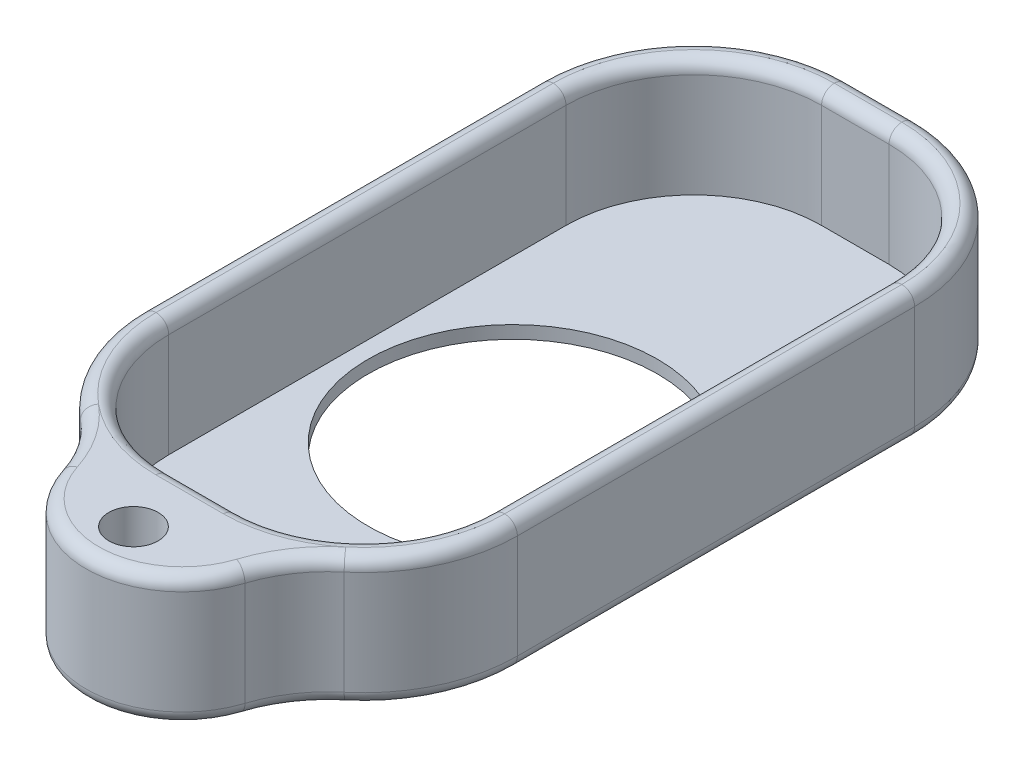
ISO-10303-21;
HEADER;
FILE_DESCRIPTION(('STEP AP214'),'2;1');
FILE_NAME('part.step','',(''),(''),'','','');
FILE_SCHEMA(('AUTOMOTIVE_DESIGN { 1 0 10303 214 1 1 1 1 }'));
ENDSEC;
DATA;
#1=APPLICATION_CONTEXT('core data for automotive mechanical design processes');
#2=APPLICATION_PROTOCOL_DEFINITION('international standard','automotive_design',2000,#1);
#3=PRODUCT_CONTEXT('',#1,'mechanical');
#4=PRODUCT('Part','Part','',(#3));
#5=PRODUCT_RELATED_PRODUCT_CATEGORY('part','',(#4));
#6=PRODUCT_DEFINITION_FORMATION('','',#4);
#7=PRODUCT_DEFINITION_CONTEXT('part definition',#1,'design');
#8=PRODUCT_DEFINITION('design','',#6,#7);
#9=PRODUCT_DEFINITION_SHAPE('','',#8);
#10=(LENGTH_UNIT() NAMED_UNIT(*) SI_UNIT(.MILLI.,.METRE.));
#11=(NAMED_UNIT(*) PLANE_ANGLE_UNIT() SI_UNIT($,.RADIAN.));
#12=(NAMED_UNIT(*) SI_UNIT($,.STERADIAN.) SOLID_ANGLE_UNIT());
#13=UNCERTAINTY_MEASURE_WITH_UNIT(LENGTH_MEASURE(1.E-05),#10,'distance_accuracy_value','');
#14=(GEOMETRIC_REPRESENTATION_CONTEXT(3) GLOBAL_UNCERTAINTY_ASSIGNED_CONTEXT((#13)) GLOBAL_UNIT_ASSIGNED_CONTEXT((#10,
#11,#12)) REPRESENTATION_CONTEXT('',''));
#15=CARTESIAN_POINT('',(0.,0.,0.));
#16=DIRECTION('',(0.,0.,1.));
#17=DIRECTION('',(1.,0.,0.));
#18=AXIS2_PLACEMENT_3D('',#15,#16,#17);
#19=CARTESIAN_POINT('',(19.4056,11.6078,-12.7));
#20=DIRECTION('',(0.,1.,0.));
#21=DIRECTION('',(0.,0.,1.));
#22=AXIS2_PLACEMENT_3D('',#19,#20,#21);
#23=PLANE('',#22);
#24=CARTESIAN_POINT('',(37.2741175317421,11.6078,8.7792849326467));
#25=DIRECTION('',(0.,1.,0.));
#26=DIRECTION('',(0.,0.,1.));
#27=AXIS2_PLACEMENT_3D('',#24,#25,#26);
#28=CIRCLE('',#27,13.97);
#29=CARTESIAN_POINT('',(23.9698904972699,11.6078,4.51801246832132));
#30=VERTEX_POINT('',#29);
#31=CARTESIAN_POINT('',(28.3398587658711,11.6078,-1.96035753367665));
#32=VERTEX_POINT('',#31);
#33=EDGE_CURVE('E435',#30,#32,#28,.F.);
#34=ORIENTED_EDGE('',*,*,#33,.T.);
#35=CARTESIAN_POINT('',(19.4056,11.6078,-12.7));
#36=DIRECTION('',(0.,1.,0.));
#37=DIRECTION('',(0.,0.,1.));
#38=AXIS2_PLACEMENT_3D('',#35,#36,#37);
#39=CIRCLE('',#38,13.97);
#40=CARTESIAN_POINT('',(19.4055999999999,11.6078,1.27));
#41=VERTEX_POINT('',#40);
#42=EDGE_CURVE('E390',#32,#41,#39,.F.);
#43=ORIENTED_EDGE('',*,*,#42,.T.);
#44=DIRECTION('',(1.,0.,0.));
#45=VECTOR('',#44,1.);
#46=CARTESIAN_POINT('',(19.4056,11.6078,1.27));
#47=LINE('',#46,#45);
#48=CARTESIAN_POINT('',(12.7000000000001,11.6078,1.27));
#49=VERTEX_POINT('',#48);
#50=EDGE_CURVE('E439',#41,#49,#47,.F.);
#51=ORIENTED_EDGE('',*,*,#50,.T.);
#52=CARTESIAN_POINT('',(12.7,11.6078,-12.7));
#53=DIRECTION('',(0.,1.,0.));
#54=DIRECTION('',(0.,0.,1.));
#55=AXIS2_PLACEMENT_3D('',#52,#53,#54);
#56=CIRCLE('',#55,13.97);
#57=CARTESIAN_POINT('',(3.75657718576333,11.6078,-1.96798768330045));
#58=VERTEX_POINT('',#57);
#59=EDGE_CURVE('E437',#49,#58,#56,.F.);
#60=ORIENTED_EDGE('',*,*,#59,.T.);
#61=CARTESIAN_POINT('',(-5.18684562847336,11.6078,8.7640246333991));
#62=DIRECTION('',(0.,1.,0.));
#63=DIRECTION('',(0.,0.,1.));
#64=AXIS2_PLACEMENT_3D('',#61,#62,#63);
#65=CIRCLE('',#64,13.97);
#66=CARTESIAN_POINT('',(8.12044093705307,11.6078,4.51231623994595));
#67=VERTEX_POINT('',#66);
#68=EDGE_CURVE('E431',#58,#67,#65,.F.);
#69=ORIENTED_EDGE('',*,*,#68,.T.);
#70=CARTESIAN_POINT('',(16.0460768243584,11.6078,1.98005750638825));
#71=DIRECTION('',(0.,1.,0.));
#72=DIRECTION('',(0.,0.,1.));
#73=AXIS2_PLACEMENT_3D('',#70,#71,#72);
#74=CIRCLE('',#73,8.3203388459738);
#75=EDGE_CURVE('E433',#67,#30,#74,.T.);
#76=ORIENTED_EDGE('',*,*,#75,.T.);
#77=EDGE_LOOP('',(#34,#43,#51,#60,#69,#76));
#78=FACE_BOUND('',#77,.T.);
#79=CARTESIAN_POINT('',(16.0426300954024,11.6078,6.84558798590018));
#80=DIRECTION('',(0.,1.,0.));
#81=DIRECTION('',(0.,0.,1.));
#82=AXIS2_PLACEMENT_3D('',#79,#80,#81);
#83=CIRCLE('',#82,2.45216289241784);
#84=CARTESIAN_POINT('',(16.0426300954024,11.6078,9.29775087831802));
#85=VERTEX_POINT('',#84);
#86=EDGE_CURVE('E325',#85,#85,#83,.T.);
#87=ORIENTED_EDGE('',*,*,#86,.F.);
#88=EDGE_LOOP('',(#87));
#89=FACE_BOUND('',#88,.T.);
#90=ADVANCED_FACE('F32',(#78,#89),#23,.T.);
#91=CARTESIAN_POINT('',(19.4056,11.6078,-12.7));
#92=DIRECTION('',(0.,-1.,0.));
#93=DIRECTION('',(0.,0.,-1.));
#94=AXIS2_PLACEMENT_3D('',#91,#92,#93);
#95=CYLINDRICAL_SURFACE('',#94,15.24);
#96=DIRECTION('',(0.,-1.,0.));
#97=VECTOR('',#96,1.);
#98=CARTESIAN_POINT('',(29.152064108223,11.6078,-0.984026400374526));
#99=LINE('',#98,#97);
#100=CARTESIAN_POINT('',(29.152064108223,10.3378,-0.984026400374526));
#101=VERTEX_POINT('',#100);
#102=CARTESIAN_POINT('',(29.152064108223,0.,-0.984026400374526));
#103=VERTEX_POINT('',#102);
#104=EDGE_CURVE('E501',#101,#103,#99,.T.);
#105=ORIENTED_EDGE('',*,*,#104,.T.);
#106=CARTESIAN_POINT('',(19.4056,0.,-12.7));
#107=DIRECTION('',(0.,-1.,0.));
#108=DIRECTION('',(0.,0.,-1.));
#109=AXIS2_PLACEMENT_3D('',#106,#107,#108);
#110=CIRCLE('',#109,15.24);
#111=CARTESIAN_POINT('',(34.6456,0.,-12.7000000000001));
#112=VERTEX_POINT('',#111);
#113=EDGE_CURVE('E401',#103,#112,#110,.F.);
#114=ORIENTED_EDGE('',*,*,#113,.T.);
#115=DIRECTION('',(0.,-1.,0.));
#116=VECTOR('',#115,1.);
#117=CARTESIAN_POINT('',(34.6456,11.6078,-12.7000000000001));
#118=LINE('',#117,#116);
#119=CARTESIAN_POINT('',(34.6456,10.3378,-12.7000000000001));
#120=VERTEX_POINT('',#119);
#121=EDGE_CURVE('E520',#120,#112,#118,.T.);
#122=ORIENTED_EDGE('',*,*,#121,.F.);
#123=CARTESIAN_POINT('',(19.4056,10.3378,-12.7));
#124=DIRECTION('',(0.,1.,0.));
#125=DIRECTION('',(0.,0.,1.));
#126=AXIS2_PLACEMENT_3D('',#123,#124,#125);
#127=CIRCLE('',#126,15.24);
#128=EDGE_CURVE('E396',#120,#101,#127,.F.);
#129=ORIENTED_EDGE('',*,*,#128,.T.);
#130=EDGE_LOOP('',(#105,#114,#122,#129));
#131=FACE_BOUND('',#130,.T.);
#132=ADVANCED_FACE('F595',(#131),#95,.T.);
#133=CARTESIAN_POINT('',(34.6456,11.6078,-12.7000000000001));
#134=DIRECTION('',(-1.,0.,0.));
#135=DIRECTION('',(0.,0.,1.));
#136=AXIS2_PLACEMENT_3D('',#133,#134,#135);
#137=PLANE('',#136);
#138=ORIENTED_EDGE('',*,*,#121,.T.);
#139=DIRECTION('',(0.,0.,1.));
#140=VECTOR('',#139,1.);
#141=CARTESIAN_POINT('',(34.6456,0.,-52.1715999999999));
#142=LINE('',#141,#140);
#143=CARTESIAN_POINT('',(34.6456,0.,-52.1715999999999));
#144=VERTEX_POINT('',#143);
#145=EDGE_CURVE('E411',#112,#144,#142,.F.);
#146=ORIENTED_EDGE('',*,*,#145,.T.);
#147=DIRECTION('',(0.,-1.,0.));
#148=VECTOR('',#147,1.);
#149=CARTESIAN_POINT('',(34.6456,11.6078,-52.1715999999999));
#150=LINE('',#149,#148);
#151=CARTESIAN_POINT('',(34.6456,10.3378,-52.1715999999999));
#152=VERTEX_POINT('',#151);
#153=EDGE_CURVE('E517',#152,#144,#150,.T.);
#154=ORIENTED_EDGE('',*,*,#153,.F.);
#155=DIRECTION('',(0.,0.,-1.));
#156=VECTOR('',#155,1.);
#157=CARTESIAN_POINT('',(34.6456,10.3378,-12.7000000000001));
#158=LINE('',#157,#156);
#159=EDGE_CURVE('E404',#152,#120,#158,.F.);
#160=ORIENTED_EDGE('',*,*,#159,.T.);
#161=EDGE_LOOP('',(#138,#146,#154,#160));
#162=FACE_BOUND('',#161,.T.);
#163=ADVANCED_FACE('F607',(#162),#137,.F.);
#164=CARTESIAN_POINT('',(19.4056,11.6078,-52.1716));
#165=DIRECTION('',(0.,-1.,0.));
#166=DIRECTION('',(0.,0.,-1.));
#167=AXIS2_PLACEMENT_3D('',#164,#165,#166);
#168=CYLINDRICAL_SURFACE('',#167,15.24);
#169=ORIENTED_EDGE('',*,*,#153,.T.);
#170=CARTESIAN_POINT('',(19.4056,0.,-52.1716));
#171=DIRECTION('',(0.,-1.,0.));
#172=DIRECTION('',(0.,0.,-1.));
#173=AXIS2_PLACEMENT_3D('',#170,#171,#172);
#174=CIRCLE('',#173,15.24);
#175=CARTESIAN_POINT('',(19.4055999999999,0.,-67.4116));
#176=VERTEX_POINT('',#175);
#177=EDGE_CURVE('E414',#144,#176,#174,.F.);
#178=ORIENTED_EDGE('',*,*,#177,.T.);
#179=DIRECTION('',(0.,-1.,0.));
#180=VECTOR('',#179,1.);
#181=CARTESIAN_POINT('',(19.4055999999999,11.6078,-67.4116));
#182=LINE('',#181,#180);
#183=CARTESIAN_POINT('',(19.4055999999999,10.3378,-67.4116));
#184=VERTEX_POINT('',#183);
#185=EDGE_CURVE('E514',#184,#176,#182,.T.);
#186=ORIENTED_EDGE('',*,*,#185,.F.);
#187=CARTESIAN_POINT('',(19.4056,10.3378,-52.1716));
#188=DIRECTION('',(0.,1.,0.));
#189=DIRECTION('',(0.,0.,1.));
#190=AXIS2_PLACEMENT_3D('',#187,#188,#189);
#191=CIRCLE('',#190,15.24);
#192=EDGE_CURVE('E368',#184,#152,#191,.F.);
#193=ORIENTED_EDGE('',*,*,#192,.T.);
#194=EDGE_LOOP('',(#169,#178,#186,#193));
#195=FACE_BOUND('',#194,.T.);
#196=ADVANCED_FACE('F610',(#195),#168,.T.);
#197=CARTESIAN_POINT('',(12.7000000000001,11.6078,-67.4116));
#198=DIRECTION('',(0.,0.,1.));
#199=DIRECTION('',(1.,0.,0.));
#200=AXIS2_PLACEMENT_3D('',#197,#198,#199);
#201=PLANE('',#200);
#202=ORIENTED_EDGE('',*,*,#185,.T.);
#203=DIRECTION('',(1.,0.,0.));
#204=VECTOR('',#203,1.);
#205=CARTESIAN_POINT('',(12.7000000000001,0.,-67.4116));
#206=LINE('',#205,#204);
#207=CARTESIAN_POINT('',(12.7000000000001,0.,-67.4116));
#208=VERTEX_POINT('',#207);
#209=EDGE_CURVE('E418',#176,#208,#206,.F.);
#210=ORIENTED_EDGE('',*,*,#209,.T.);
#211=DIRECTION('',(0.,-1.,0.));
#212=VECTOR('',#211,1.);
#213=CARTESIAN_POINT('',(12.7000000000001,11.6078,-67.4116));
#214=LINE('',#213,#212);
#215=CARTESIAN_POINT('',(12.7000000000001,10.3378,-67.4116));
#216=VERTEX_POINT('',#215);
#217=EDGE_CURVE('E511',#216,#208,#214,.T.);
#218=ORIENTED_EDGE('',*,*,#217,.F.);
#219=DIRECTION('',(-1.,0.,0.));
#220=VECTOR('',#219,1.);
#221=CARTESIAN_POINT('',(19.4055999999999,10.3378,-67.4116));
#222=LINE('',#221,#220);
#223=EDGE_CURVE('E416',#216,#184,#222,.F.);
#224=ORIENTED_EDGE('',*,*,#223,.T.);
#225=EDGE_LOOP('',(#202,#210,#218,#224));
#226=FACE_BOUND('',#225,.T.);
#227=ADVANCED_FACE('F624',(#226),#201,.F.);
#228=CARTESIAN_POINT('',(12.7,11.6078,-52.1716));
#229=DIRECTION('',(0.,-1.,0.));
#230=DIRECTION('',(0.,0.,-1.));
#231=AXIS2_PLACEMENT_3D('',#228,#229,#230);
#232=CYLINDRICAL_SURFACE('',#231,15.24);
#233=ORIENTED_EDGE('',*,*,#217,.T.);
#234=CARTESIAN_POINT('',(12.7,0.,-52.1716));
#235=DIRECTION('',(0.,-1.,0.));
#236=DIRECTION('',(0.,0.,-1.));
#237=AXIS2_PLACEMENT_3D('',#234,#235,#236);
#238=CIRCLE('',#237,15.24);
#239=CARTESIAN_POINT('',(-2.54,0.,-52.1715999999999));
#240=VERTEX_POINT('',#239);
#241=EDGE_CURVE('E422',#208,#240,#238,.F.);
#242=ORIENTED_EDGE('',*,*,#241,.T.);
#243=DIRECTION('',(0.,-1.,0.));
#244=VECTOR('',#243,1.);
#245=CARTESIAN_POINT('',(-2.54,11.6078,-52.1715999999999));
#246=LINE('',#245,#244);
#247=CARTESIAN_POINT('',(-2.54,10.3378,-52.1715999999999));
#248=VERTEX_POINT('',#247);
#249=EDGE_CURVE('E466',#248,#240,#246,.T.);
#250=ORIENTED_EDGE('',*,*,#249,.F.);
#251=CARTESIAN_POINT('',(12.7,10.3378,-52.1716));
#252=DIRECTION('',(0.,1.,0.));
#253=DIRECTION('',(0.,0.,1.));
#254=AXIS2_PLACEMENT_3D('',#251,#252,#253);
#255=CIRCLE('',#254,15.24);
#256=EDGE_CURVE('E420',#248,#216,#255,.F.);
#257=ORIENTED_EDGE('',*,*,#256,.T.);
#258=EDGE_LOOP('',(#233,#242,#250,#257));
#259=FACE_BOUND('',#258,.T.);
#260=ADVANCED_FACE('F626',(#259),#232,.T.);
#261=CARTESIAN_POINT('',(-2.54,11.6078,-12.7000000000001));
#262=DIRECTION('',(1.,0.,0.));
#263=DIRECTION('',(0.,0.,-1.));
#264=AXIS2_PLACEMENT_3D('',#261,#262,#263);
#265=PLANE('',#264);
#266=ORIENTED_EDGE('',*,*,#249,.T.);
#267=DIRECTION('',(0.,0.,-1.));
#268=VECTOR('',#267,1.);
#269=CARTESIAN_POINT('',(-2.54,0.,-12.7000000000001));
#270=LINE('',#269,#268);
#271=CARTESIAN_POINT('',(-2.54,0.,-12.7000000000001));
#272=VERTEX_POINT('',#271);
#273=EDGE_CURVE('E426',#240,#272,#270,.F.);
#274=ORIENTED_EDGE('',*,*,#273,.T.);
#275=DIRECTION('',(0.,-1.,0.));
#276=VECTOR('',#275,1.);
#277=CARTESIAN_POINT('',(-2.54,11.6078,-12.7000000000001));
#278=LINE('',#277,#276);
#279=CARTESIAN_POINT('',(-2.54,10.3378,-12.7000000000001));
#280=VERTEX_POINT('',#279);
#281=EDGE_CURVE('E455',#280,#272,#278,.T.);
#282=ORIENTED_EDGE('',*,*,#281,.F.);
#283=DIRECTION('',(0.,0.,1.));
#284=VECTOR('',#283,1.);
#285=CARTESIAN_POINT('',(-2.54,10.3378,-52.1715999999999));
#286=LINE('',#285,#284);
#287=EDGE_CURVE('E424',#280,#248,#286,.F.);
#288=ORIENTED_EDGE('',*,*,#287,.T.);
#289=EDGE_LOOP('',(#266,#274,#282,#288));
#290=FACE_BOUND('',#289,.T.);
#291=ADVANCED_FACE('F463',(#290),#265,.F.);
#292=CARTESIAN_POINT('',(12.7,11.6078,-12.7));
#293=DIRECTION('',(0.,-1.,0.));
#294=DIRECTION('',(0.,0.,-1.));
#295=AXIS2_PLACEMENT_3D('',#292,#293,#294);
#296=CYLINDRICAL_SURFACE('',#295,15.24);
#297=DIRECTION('',(0.,-1.,0.));
#298=VECTOR('',#297,1.);
#299=CARTESIAN_POINT('',(2.94353874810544,11.6078,-0.992350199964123));
#300=LINE('',#299,#298);
#301=CARTESIAN_POINT('',(2.94353874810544,10.3378,-0.992350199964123));
#302=VERTEX_POINT('',#301);
#303=CARTESIAN_POINT('',(2.94353874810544,0.,-0.992350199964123));
#304=VERTEX_POINT('',#303);
#305=EDGE_CURVE('E458',#302,#304,#300,.T.);
#306=ORIENTED_EDGE('',*,*,#305,.F.);
#307=CARTESIAN_POINT('',(12.7,10.3378,-12.7));
#308=DIRECTION('',(0.,1.,0.));
#309=DIRECTION('',(0.,0.,1.));
#310=AXIS2_PLACEMENT_3D('',#307,#308,#309);
#311=CIRCLE('',#310,15.24);
#312=EDGE_CURVE('E42',#302,#280,#311,.F.);
#313=ORIENTED_EDGE('',*,*,#312,.T.);
#314=ORIENTED_EDGE('',*,*,#281,.T.);
#315=CARTESIAN_POINT('',(12.7,0.,-12.7));
#316=DIRECTION('',(0.,-1.,0.));
#317=DIRECTION('',(0.,0.,-1.));
#318=AXIS2_PLACEMENT_3D('',#315,#316,#317);
#319=CIRCLE('',#318,15.24);
#320=EDGE_CURVE('E448',#272,#304,#319,.F.);
#321=ORIENTED_EDGE('',*,*,#320,.T.);
#322=EDGE_LOOP('',(#306,#313,#314,#321));
#323=FACE_BOUND('',#322,.T.);
#324=ADVANCED_FACE('F454',(#323),#296,.T.);
#325=CARTESIAN_POINT('',(-5.18684562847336,11.6078,8.7640246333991));
#326=DIRECTION('',(0.,-1.,0.));
#327=DIRECTION('',(0.,0.,-1.));
#328=AXIS2_PLACEMENT_3D('',#325,#326,#327);
#329=CYLINDRICAL_SURFACE('',#328,12.7);
#330=ORIENTED_EDGE('',*,*,#305,.T.);
#331=CARTESIAN_POINT('',(-5.18684562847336,0.,8.7640246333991));
#332=DIRECTION('',(0.,-1.,0.));
#333=DIRECTION('',(0.,0.,-1.));
#334=AXIS2_PLACEMENT_3D('',#331,#332,#333);
#335=CIRCLE('',#334,12.7);
#336=CARTESIAN_POINT('',(6.9106876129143,0.,4.89883518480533));
#337=VERTEX_POINT('',#336);
#338=EDGE_CURVE('E546',#304,#337,#335,.T.);
#339=ORIENTED_EDGE('',*,*,#338,.T.);
#340=DIRECTION('',(0.,-1.,0.));
#341=VECTOR('',#340,1.);
#342=CARTESIAN_POINT('',(6.9106876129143,11.6078,4.89883518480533));
#343=LINE('',#342,#341);
#344=CARTESIAN_POINT('',(6.9106876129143,10.3378,4.89883518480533));
#345=VERTEX_POINT('',#344);
#346=EDGE_CURVE('E506',#345,#337,#343,.T.);
#347=ORIENTED_EDGE('',*,*,#346,.F.);
#348=CARTESIAN_POINT('',(-5.18684562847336,10.3378,8.7640246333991));
#349=DIRECTION('',(0.,1.,0.));
#350=DIRECTION('',(0.,0.,1.));
#351=AXIS2_PLACEMENT_3D('',#348,#349,#350);
#352=CIRCLE('',#351,12.7);
#353=EDGE_CURVE('E544',#345,#302,#352,.T.);
#354=ORIENTED_EDGE('',*,*,#353,.T.);
#355=EDGE_LOOP('',(#330,#339,#347,#354));
#356=FACE_BOUND('',#355,.T.);
#357=ADVANCED_FACE('F576',(#356),#329,.F.);
#358=CARTESIAN_POINT('',(16.0460768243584,11.6078,1.98005750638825));
#359=DIRECTION('',(0.,-1.,0.));
#360=DIRECTION('',(0.,0.,-1.));
#361=AXIS2_PLACEMENT_3D('',#358,#359,#360);
#362=CYLINDRICAL_SURFACE('',#361,9.5903388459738);
#363=ORIENTED_EDGE('',*,*,#346,.T.);
#364=CARTESIAN_POINT('',(16.0460768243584,0.,1.98005750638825));
#365=DIRECTION('',(0.,-1.,0.));
#366=DIRECTION('',(0.,0.,-1.));
#367=AXIS2_PLACEMENT_3D('',#364,#365,#366);
#368=CIRCLE('',#367,9.5903388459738);
#369=CARTESIAN_POINT('',(25.1793656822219,0.,4.90540087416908));
#370=VERTEX_POINT('',#369);
#371=EDGE_CURVE('E551',#337,#370,#368,.F.);
#372=ORIENTED_EDGE('',*,*,#371,.T.);
#373=DIRECTION('',(0.,-1.,0.));
#374=VECTOR('',#373,1.);
#375=CARTESIAN_POINT('',(25.1793656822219,11.6078,4.90540087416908));
#376=LINE('',#375,#374);
#377=CARTESIAN_POINT('',(25.1793656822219,10.3378,4.90540087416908));
#378=VERTEX_POINT('',#377);
#379=EDGE_CURVE('E503',#378,#370,#376,.T.);
#380=ORIENTED_EDGE('',*,*,#379,.F.);
#381=CARTESIAN_POINT('',(16.0460768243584,10.3378,1.98005750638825));
#382=DIRECTION('',(0.,1.,0.));
#383=DIRECTION('',(0.,0.,1.));
#384=AXIS2_PLACEMENT_3D('',#381,#382,#383);
#385=CIRCLE('',#384,9.5903388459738);
#386=EDGE_CURVE('E549',#378,#345,#385,.F.);
#387=ORIENTED_EDGE('',*,*,#386,.T.);
#388=EDGE_LOOP('',(#363,#372,#380,#387));
#389=FACE_BOUND('',#388,.T.);
#390=ADVANCED_FACE('F559',(#389),#362,.T.);
#391=CARTESIAN_POINT('',(37.2741175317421,11.6078,8.7792849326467));
#392=DIRECTION('',(0.,-1.,0.));
#393=DIRECTION('',(0.,0.,-1.));
#394=AXIS2_PLACEMENT_3D('',#391,#392,#393);
#395=CYLINDRICAL_SURFACE('',#394,12.7);
#396=ORIENTED_EDGE('',*,*,#379,.T.);
#397=CARTESIAN_POINT('',(37.2741175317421,0.,8.7792849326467));
#398=DIRECTION('',(0.,-1.,0.));
#399=DIRECTION('',(0.,0.,-1.));
#400=AXIS2_PLACEMENT_3D('',#397,#398,#399);
#401=CIRCLE('',#400,12.7);
#402=EDGE_CURVE('E402',#370,#103,#401,.T.);
#403=ORIENTED_EDGE('',*,*,#402,.T.);
#404=ORIENTED_EDGE('',*,*,#104,.F.);
#405=CARTESIAN_POINT('',(37.2741175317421,10.3378,8.7792849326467));
#406=DIRECTION('',(0.,1.,0.));
#407=DIRECTION('',(0.,0.,1.));
#408=AXIS2_PLACEMENT_3D('',#405,#406,#407);
#409=CIRCLE('',#408,12.7);
#410=EDGE_CURVE('E406',#101,#378,#409,.T.);
#411=ORIENTED_EDGE('',*,*,#410,.T.);
#412=EDGE_LOOP('',(#396,#403,#404,#411));
#413=FACE_BOUND('',#412,.T.);
#414=ADVANCED_FACE('F554',(#413),#395,.F.);
#415=CARTESIAN_POINT('',(12.7,11.6078,-12.7));
#416=DIRECTION('',(0.,-1.,0.));
#417=DIRECTION('',(0.,0.,-1.));
#418=AXIS2_PLACEMENT_3D('',#415,#416,#417);
#419=CYLINDRICAL_SURFACE('',#418,12.7);
#420=DIRECTION('',(0.,-1.,0.));
#421=VECTOR('',#420,1.);
#422=CARTESIAN_POINT('',(0.,11.6078,-12.7000000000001));
#423=LINE('',#422,#421);
#424=CARTESIAN_POINT('',(0.,10.3378,-12.7000000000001));
#425=VERTEX_POINT('',#424);
#426=CARTESIAN_POINT('',(0.,0.,-12.7000000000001));
#427=VERTEX_POINT('',#426);
#428=EDGE_CURVE('E85',#425,#427,#423,.T.);
#429=ORIENTED_EDGE('',*,*,#428,.F.);
#430=CARTESIAN_POINT('',(12.7,10.3378,-12.7));
#431=DIRECTION('',(0.,1.,0.));
#432=DIRECTION('',(0.,0.,1.));
#433=AXIS2_PLACEMENT_3D('',#430,#431,#432);
#434=CIRCLE('',#433,12.7);
#435=CARTESIAN_POINT('',(12.7000000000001,10.3378,0.));
#436=VERTEX_POINT('',#435);
#437=EDGE_CURVE('E444',#425,#436,#434,.T.);
#438=ORIENTED_EDGE('',*,*,#437,.T.);
#439=DIRECTION('',(0.,-1.,0.));
#440=VECTOR('',#439,1.);
#441=CARTESIAN_POINT('',(12.7000000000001,11.6078,0.));
#442=LINE('',#441,#440);
#443=CARTESIAN_POINT('',(12.7000000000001,0.,0.));
#444=VERTEX_POINT('',#443);
#445=EDGE_CURVE('E499',#436,#444,#442,.T.);
#446=ORIENTED_EDGE('',*,*,#445,.T.);
#447=CARTESIAN_POINT('',(12.7,0.,-12.7));
#448=DIRECTION('',(0.,1.,0.));
#449=DIRECTION('',(0.,0.,-1.));
#450=AXIS2_PLACEMENT_3D('',#447,#448,#449);
#451=CIRCLE('',#450,12.7);
#452=EDGE_CURVE('E484',#427,#444,#451,.T.);
#453=ORIENTED_EDGE('',*,*,#452,.F.);
#454=EDGE_LOOP('',(#429,#438,#446,#453));
#455=FACE_BOUND('',#454,.T.);
#456=ADVANCED_FACE('F481',(#455),#419,.F.);
#457=CARTESIAN_POINT('',(12.7000000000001,11.6078,0.));
#458=DIRECTION('',(0.,0.,-1.));
#459=DIRECTION('',(-1.,0.,0.));
#460=AXIS2_PLACEMENT_3D('',#457,#458,#459);
#461=PLANE('',#460);
#462=ORIENTED_EDGE('',*,*,#445,.F.);
#463=DIRECTION('',(1.,0.,0.));
#464=VECTOR('',#463,1.);
#465=CARTESIAN_POINT('',(12.7000000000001,10.3378,0.));
#466=LINE('',#465,#464);
#467=CARTESIAN_POINT('',(19.4055999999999,10.3378,0.));
#468=VERTEX_POINT('',#467);
#469=EDGE_CURVE('E442',#436,#468,#466,.T.);
#470=ORIENTED_EDGE('',*,*,#469,.T.);
#471=DIRECTION('',(0.,-1.,0.));
#472=VECTOR('',#471,1.);
#473=CARTESIAN_POINT('',(19.4055999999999,11.6078,0.));
#474=LINE('',#473,#472);
#475=CARTESIAN_POINT('',(19.4055999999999,0.,0.));
#476=VERTEX_POINT('',#475);
#477=EDGE_CURVE('E497',#468,#476,#474,.T.);
#478=ORIENTED_EDGE('',*,*,#477,.T.);
#479=DIRECTION('',(1.,0.,0.));
#480=VECTOR('',#479,1.);
#481=CARTESIAN_POINT('',(12.7000000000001,0.,0.));
#482=LINE('',#481,#480);
#483=EDGE_CURVE('E1084',#444,#476,#482,.T.);
#484=ORIENTED_EDGE('',*,*,#483,.F.);
#485=EDGE_LOOP('',(#462,#470,#478,#484));
#486=FACE_BOUND('',#485,.T.);
#487=ADVANCED_FACE('F1030',(#486),#461,.T.);
#488=CARTESIAN_POINT('',(19.4056,11.6078,-12.7));
#489=DIRECTION('',(0.,-1.,0.));
#490=DIRECTION('',(0.,0.,-1.));
#491=AXIS2_PLACEMENT_3D('',#488,#489,#490);
#492=CYLINDRICAL_SURFACE('',#491,12.7);
#493=ORIENTED_EDGE('',*,*,#477,.F.);
#494=CARTESIAN_POINT('',(19.4056,10.3378,-12.7));
#495=DIRECTION('',(0.,1.,0.));
#496=DIRECTION('',(0.,0.,1.));
#497=AXIS2_PLACEMENT_3D('',#494,#495,#496);
#498=CIRCLE('',#497,12.7);
#499=CARTESIAN_POINT('',(32.1056,10.3378,-12.7000000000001));
#500=VERTEX_POINT('',#499);
#501=EDGE_CURVE('E428',#468,#500,#498,.T.);
#502=ORIENTED_EDGE('',*,*,#501,.T.);
#503=DIRECTION('',(0.,-1.,0.));
#504=VECTOR('',#503,1.);
#505=CARTESIAN_POINT('',(32.1056,11.6078,-12.7000000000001));
#506=LINE('',#505,#504);
#507=CARTESIAN_POINT('',(32.1056,0.,-12.7000000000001));
#508=VERTEX_POINT('',#507);
#509=EDGE_CURVE('E495',#500,#508,#506,.T.);
#510=ORIENTED_EDGE('',*,*,#509,.T.);
#511=CARTESIAN_POINT('',(19.4056,0.,-12.7));
#512=DIRECTION('',(0.,1.,0.));
#513=DIRECTION('',(0.,0.,1.));
#514=AXIS2_PLACEMENT_3D('',#511,#512,#513);
#515=CIRCLE('',#514,12.7);
#516=EDGE_CURVE('E1096',#476,#508,#515,.T.);
#517=ORIENTED_EDGE('',*,*,#516,.F.);
#518=EDGE_LOOP('',(#493,#502,#510,#517));
#519=FACE_BOUND('',#518,.T.);
#520=ADVANCED_FACE('F1022',(#519),#492,.F.);
#521=CARTESIAN_POINT('',(32.1056,11.6078,-12.7000000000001));
#522=DIRECTION('',(-1.,0.,0.));
#523=DIRECTION('',(0.,0.,1.));
#524=AXIS2_PLACEMENT_3D('',#521,#522,#523);
#525=PLANE('',#524);
#526=ORIENTED_EDGE('',*,*,#509,.F.);
#527=DIRECTION('',(0.,0.,-1.));
#528=VECTOR('',#527,1.);
#529=CARTESIAN_POINT('',(32.1056,10.3378,-12.7000000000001));
#530=LINE('',#529,#528);
#531=CARTESIAN_POINT('',(32.1056,10.3378,-52.1715999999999));
#532=VERTEX_POINT('',#531);
#533=EDGE_CURVE('E11',#500,#532,#530,.T.);
#534=ORIENTED_EDGE('',*,*,#533,.T.);
#535=DIRECTION('',(0.,-1.,0.));
#536=VECTOR('',#535,1.);
#537=CARTESIAN_POINT('',(32.1056,11.6078,-52.1715999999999));
#538=LINE('',#537,#536);
#539=CARTESIAN_POINT('',(32.1056,0.,-52.1715999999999));
#540=VERTEX_POINT('',#539);
#541=EDGE_CURVE('E493',#532,#540,#538,.T.);
#542=ORIENTED_EDGE('',*,*,#541,.T.);
#543=DIRECTION('',(0.,0.,-1.));
#544=VECTOR('',#543,1.);
#545=CARTESIAN_POINT('',(32.1056,0.,-12.7000000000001));
#546=LINE('',#545,#544);
#547=EDGE_CURVE('E1090',#508,#540,#546,.T.);
#548=ORIENTED_EDGE('',*,*,#547,.F.);
#549=EDGE_LOOP('',(#526,#534,#542,#548));
#550=FACE_BOUND('',#549,.T.);
#551=ADVANCED_FACE('F1013',(#550),#525,.T.);
#552=CARTESIAN_POINT('',(19.4056,11.6078,-52.1716));
#553=DIRECTION('',(0.,-1.,0.));
#554=DIRECTION('',(0.,0.,-1.));
#555=AXIS2_PLACEMENT_3D('',#552,#553,#554);
#556=CYLINDRICAL_SURFACE('',#555,12.7);
#557=ORIENTED_EDGE('',*,*,#541,.F.);
#558=CARTESIAN_POINT('',(19.4056,10.3378,-52.1716));
#559=DIRECTION('',(0.,1.,0.));
#560=DIRECTION('',(0.,0.,1.));
#561=AXIS2_PLACEMENT_3D('',#558,#559,#560);
#562=CIRCLE('',#561,12.7);
#563=CARTESIAN_POINT('',(19.4055999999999,10.3378,-64.8716));
#564=VERTEX_POINT('',#563);
#565=EDGE_CURVE('E243',#532,#564,#562,.T.);
#566=ORIENTED_EDGE('',*,*,#565,.T.);
#567=DIRECTION('',(0.,-1.,0.));
#568=VECTOR('',#567,1.);
#569=CARTESIAN_POINT('',(19.4055999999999,11.6078,-64.8716));
#570=LINE('',#569,#568);
#571=CARTESIAN_POINT('',(19.4055999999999,0.,-64.8716));
#572=VERTEX_POINT('',#571);
#573=EDGE_CURVE('E238',#564,#572,#570,.T.);
#574=ORIENTED_EDGE('',*,*,#573,.T.);
#575=CARTESIAN_POINT('',(19.4056,0.,-52.1716));
#576=DIRECTION('',(0.,1.,0.));
#577=DIRECTION('',(0.,0.,-1.));
#578=AXIS2_PLACEMENT_3D('',#575,#576,#577);
#579=CIRCLE('',#578,12.7);
#580=EDGE_CURVE('E1095',#540,#572,#579,.T.);
#581=ORIENTED_EDGE('',*,*,#580,.F.);
#582=EDGE_LOOP('',(#557,#566,#574,#581));
#583=FACE_BOUND('',#582,.T.);
#584=ADVANCED_FACE('F1005',(#583),#556,.F.);
#585=CARTESIAN_POINT('',(12.7000000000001,11.6078,-64.8716));
#586=DIRECTION('',(0.,0.,1.));
#587=DIRECTION('',(1.,0.,0.));
#588=AXIS2_PLACEMENT_3D('',#585,#586,#587);
#589=PLANE('',#588);
#590=ORIENTED_EDGE('',*,*,#573,.F.);
#591=DIRECTION('',(-1.,0.,0.));
#592=VECTOR('',#591,1.);
#593=CARTESIAN_POINT('',(12.7000000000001,10.3378,-64.8716));
#594=LINE('',#593,#592);
#595=CARTESIAN_POINT('',(12.7000000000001,10.3378,-64.8716));
#596=VERTEX_POINT('',#595);
#597=EDGE_CURVE('E232',#564,#596,#594,.T.);
#598=ORIENTED_EDGE('',*,*,#597,.T.);
#599=DIRECTION('',(0.,-1.,0.));
#600=VECTOR('',#599,1.);
#601=CARTESIAN_POINT('',(12.7000000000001,11.6078,-64.8716));
#602=LINE('',#601,#600);
#603=CARTESIAN_POINT('',(12.7000000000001,0.,-64.8716));
#604=VERTEX_POINT('',#603);
#605=EDGE_CURVE('E236',#596,#604,#602,.T.);
#606=ORIENTED_EDGE('',*,*,#605,.T.);
#607=DIRECTION('',(-1.,0.,0.));
#608=VECTOR('',#607,1.);
#609=CARTESIAN_POINT('',(12.7000000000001,0.,-64.8716));
#610=LINE('',#609,#608);
#611=EDGE_CURVE('E1103',#572,#604,#610,.T.);
#612=ORIENTED_EDGE('',*,*,#611,.F.);
#613=EDGE_LOOP('',(#590,#598,#606,#612));
#614=FACE_BOUND('',#613,.T.);
#615=ADVANCED_FACE('F234',(#614),#589,.T.);
#616=CARTESIAN_POINT('',(12.7,11.6078,-52.1716));
#617=DIRECTION('',(0.,-1.,0.));
#618=DIRECTION('',(0.,0.,-1.));
#619=AXIS2_PLACEMENT_3D('',#616,#617,#618);
#620=CYLINDRICAL_SURFACE('',#619,12.7);
#621=ORIENTED_EDGE('',*,*,#605,.F.);
#622=CARTESIAN_POINT('',(12.7,10.3378,-52.1716));
#623=DIRECTION('',(0.,1.,0.));
#624=DIRECTION('',(0.,0.,1.));
#625=AXIS2_PLACEMENT_3D('',#622,#623,#624);
#626=CIRCLE('',#625,12.7);
#627=CARTESIAN_POINT('',(0.,10.3378,-52.1715999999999));
#628=VERTEX_POINT('',#627);
#629=EDGE_CURVE('E244',#596,#628,#626,.T.);
#630=ORIENTED_EDGE('',*,*,#629,.T.);
#631=DIRECTION('',(0.,-1.,0.));
#632=VECTOR('',#631,1.);
#633=CARTESIAN_POINT('',(0.,11.6078,-52.1715999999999));
#634=LINE('',#633,#632);
#635=CARTESIAN_POINT('',(0.,0.,-52.1715999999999));
#636=VERTEX_POINT('',#635);
#637=EDGE_CURVE('E253',#628,#636,#634,.T.);
#638=ORIENTED_EDGE('',*,*,#637,.T.);
#639=CARTESIAN_POINT('',(12.7,0.,-52.1716));
#640=DIRECTION('',(0.,1.,0.));
#641=DIRECTION('',(0.,0.,-1.));
#642=AXIS2_PLACEMENT_3D('',#639,#640,#641);
#643=CIRCLE('',#642,12.7);
#644=EDGE_CURVE('E251',#604,#636,#643,.T.);
#645=ORIENTED_EDGE('',*,*,#644,.F.);
#646=EDGE_LOOP('',(#621,#630,#638,#645));
#647=FACE_BOUND('',#646,.T.);
#648=ADVANCED_FACE('F248',(#647),#620,.F.);
#649=CARTESIAN_POINT('',(0.,11.6078,-12.7000000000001));
#650=DIRECTION('',(1.,0.,0.));
#651=DIRECTION('',(0.,0.,-1.));
#652=AXIS2_PLACEMENT_3D('',#649,#650,#651);
#653=PLANE('',#652);
#654=ORIENTED_EDGE('',*,*,#637,.F.);
#655=DIRECTION('',(0.,0.,1.));
#656=VECTOR('',#655,1.);
#657=CARTESIAN_POINT('',(0.,10.3378,-12.7000000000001));
#658=LINE('',#657,#656);
#659=EDGE_CURVE('E264',#628,#425,#658,.T.);
#660=ORIENTED_EDGE('',*,*,#659,.T.);
#661=ORIENTED_EDGE('',*,*,#428,.T.);
#662=DIRECTION('',(0.,0.,1.));
#663=VECTOR('',#662,1.);
#664=CARTESIAN_POINT('',(0.,0.,-12.7000000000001));
#665=LINE('',#664,#663);
#666=EDGE_CURVE('E486',#636,#427,#665,.T.);
#667=ORIENTED_EDGE('',*,*,#666,.F.);
#668=EDGE_LOOP('',(#654,#660,#661,#667));
#669=FACE_BOUND('',#668,.T.);
#670=ADVANCED_FACE('F479',(#669),#653,.T.);
#671=CARTESIAN_POINT('',(19.4056,0.,-52.1716));
#672=DIRECTION('',(0.,-1.,0.));
#673=DIRECTION('',(0.,0.,-1.));
#674=AXIS2_PLACEMENT_3D('',#671,#672,#673);
#675=PLANE('',#674);
#676=CARTESIAN_POINT('',(16.0528,0.,-30.8356));
#677=DIRECTION('',(0.,-1.,0.));
#678=DIRECTION('',(0.,0.,-1.));
#679=AXIS2_PLACEMENT_3D('',#676,#677,#678);
#680=CIRCLE('',#679,14.3777449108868);
#681=CARTESIAN_POINT('',(16.0528,0.,-45.2133449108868));
#682=VERTEX_POINT('',#681);
#683=EDGE_CURVE('E1104',#682,#682,#680,.F.);
#684=ORIENTED_EDGE('',*,*,#683,.F.);
#685=EDGE_LOOP('',(#684));
#686=FACE_BOUND('',#685,.T.);
#687=ORIENTED_EDGE('',*,*,#452,.T.);
#688=ORIENTED_EDGE('',*,*,#483,.T.);
#689=ORIENTED_EDGE('',*,*,#516,.T.);
#690=ORIENTED_EDGE('',*,*,#547,.T.);
#691=ORIENTED_EDGE('',*,*,#580,.T.);
#692=ORIENTED_EDGE('',*,*,#611,.T.);
#693=ORIENTED_EDGE('',*,*,#644,.T.);
#694=ORIENTED_EDGE('',*,*,#666,.T.);
#695=EDGE_LOOP('',(#687,#688,#689,#690,#691,#692,#693,#694));
#696=FACE_BOUND('',#695,.T.);
#697=ADVANCED_FACE('F893',(#686,#696),#675,.F.);
#698=CARTESIAN_POINT('',(19.4056,-1.27,-52.1716));
#699=DIRECTION('',(0.,-1.,0.));
#700=DIRECTION('',(0.,0.,-1.));
#701=AXIS2_PLACEMENT_3D('',#698,#699,#700);
#702=PLANE('',#701);
#703=CARTESIAN_POINT('',(16.0460768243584,-1.27,1.98005750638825));
#704=DIRECTION('',(0.,-1.,0.));
#705=DIRECTION('',(0.,0.,-1.));
#706=AXIS2_PLACEMENT_3D('',#703,#704,#705);
#707=CIRCLE('',#706,8.3203388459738);
#708=CARTESIAN_POINT('',(23.9698904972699,-1.27,4.51801246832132));
#709=VERTEX_POINT('',#708);
#710=CARTESIAN_POINT('',(8.12044093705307,-1.27,4.51231623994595));
#711=VERTEX_POINT('',#710);
#712=EDGE_CURVE('E539',#709,#711,#707,.T.);
#713=ORIENTED_EDGE('',*,*,#712,.T.);
#714=CARTESIAN_POINT('',(-5.18684562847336,-1.27,8.7640246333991));
#715=DIRECTION('',(0.,-1.,0.));
#716=DIRECTION('',(0.,0.,-1.));
#717=AXIS2_PLACEMENT_3D('',#714,#715,#716);
#718=CIRCLE('',#717,13.97);
#719=CARTESIAN_POINT('',(3.75657718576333,-1.27,-1.96798768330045));
#720=VERTEX_POINT('',#719);
#721=EDGE_CURVE('E541',#711,#720,#718,.F.);
#722=ORIENTED_EDGE('',*,*,#721,.T.);
#723=CARTESIAN_POINT('',(12.7,-1.27,-12.7));
#724=DIRECTION('',(0.,-1.,0.));
#725=DIRECTION('',(0.,0.,-1.));
#726=AXIS2_PLACEMENT_3D('',#723,#724,#725);
#727=CIRCLE('',#726,13.97);
#728=CARTESIAN_POINT('',(-1.27,-1.27,-12.7000000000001));
#729=VERTEX_POINT('',#728);
#730=EDGE_CURVE('E523',#720,#729,#727,.T.);
#731=ORIENTED_EDGE('',*,*,#730,.T.);
#732=DIRECTION('',(0.,0.,-1.));
#733=VECTOR('',#732,1.);
#734=CARTESIAN_POINT('',(-1.27,-1.27,-52.1715999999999));
#735=LINE('',#734,#733);
#736=CARTESIAN_POINT('',(-1.27,-1.27,-52.1715999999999));
#737=VERTEX_POINT('',#736);
#738=EDGE_CURVE('E525',#729,#737,#735,.T.);
#739=ORIENTED_EDGE('',*,*,#738,.T.);
#740=CARTESIAN_POINT('',(12.7,-1.27,-52.1716));
#741=DIRECTION('',(0.,-1.,0.));
#742=DIRECTION('',(0.,0.,-1.));
#743=AXIS2_PLACEMENT_3D('',#740,#741,#742);
#744=CIRCLE('',#743,13.97);
#745=CARTESIAN_POINT('',(12.7000000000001,-1.27,-66.1416));
#746=VERTEX_POINT('',#745);
#747=EDGE_CURVE('E527',#737,#746,#744,.T.);
#748=ORIENTED_EDGE('',*,*,#747,.T.);
#749=DIRECTION('',(1.,0.,0.));
#750=VECTOR('',#749,1.);
#751=CARTESIAN_POINT('',(19.4055999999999,-1.27,-66.1416));
#752=LINE('',#751,#750);
#753=CARTESIAN_POINT('',(19.4055999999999,-1.27,-66.1416));
#754=VERTEX_POINT('',#753);
#755=EDGE_CURVE('E529',#746,#754,#752,.T.);
#756=ORIENTED_EDGE('',*,*,#755,.T.);
#757=CARTESIAN_POINT('',(19.4056,-1.27,-52.1716));
#758=DIRECTION('',(0.,-1.,0.));
#759=DIRECTION('',(0.,0.,-1.));
#760=AXIS2_PLACEMENT_3D('',#757,#758,#759);
#761=CIRCLE('',#760,13.97);
#762=CARTESIAN_POINT('',(33.3756,-1.27,-52.1715999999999));
#763=VERTEX_POINT('',#762);
#764=EDGE_CURVE('E531',#754,#763,#761,.T.);
#765=ORIENTED_EDGE('',*,*,#764,.T.);
#766=DIRECTION('',(0.,0.,1.));
#767=VECTOR('',#766,1.);
#768=CARTESIAN_POINT('',(33.3756,-1.27,-12.7000000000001));
#769=LINE('',#768,#767);
#770=CARTESIAN_POINT('',(33.3756,-1.27,-12.7000000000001));
#771=VERTEX_POINT('',#770);
#772=EDGE_CURVE('E533',#763,#771,#769,.T.);
#773=ORIENTED_EDGE('',*,*,#772,.T.);
#774=CARTESIAN_POINT('',(19.4056,-1.27,-12.7));
#775=DIRECTION('',(0.,-1.,0.));
#776=DIRECTION('',(0.,0.,-1.));
#777=AXIS2_PLACEMENT_3D('',#774,#775,#776);
#778=CIRCLE('',#777,13.97);
#779=CARTESIAN_POINT('',(28.3398587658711,-1.27,-1.96035753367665));
#780=VERTEX_POINT('',#779);
#781=EDGE_CURVE('E535',#771,#780,#778,.T.);
#782=ORIENTED_EDGE('',*,*,#781,.T.);
#783=CARTESIAN_POINT('',(37.2741175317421,-1.27,8.7792849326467));
#784=DIRECTION('',(0.,-1.,0.));
#785=DIRECTION('',(0.,0.,-1.));
#786=AXIS2_PLACEMENT_3D('',#783,#784,#785);
#787=CIRCLE('',#786,13.97);
#788=EDGE_CURVE('E537',#780,#709,#787,.F.);
#789=ORIENTED_EDGE('',*,*,#788,.T.);
#790=EDGE_LOOP('',(#713,#722,#731,#739,#748,#756,#765,#773,#782,#789));
#791=FACE_BOUND('',#790,.T.);
#792=CARTESIAN_POINT('',(16.0426300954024,-1.27,6.84558798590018));
#793=DIRECTION('',(0.,1.,0.));
#794=DIRECTION('',(0.,0.,1.));
#795=AXIS2_PLACEMENT_3D('',#792,#793,#794);
#796=CIRCLE('',#795,2.45216289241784);
#797=CARTESIAN_POINT('',(16.0426300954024,-1.27,9.29775087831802));
#798=VERTEX_POINT('',#797);
#799=EDGE_CURVE('E1111',#798,#798,#796,.T.);
#800=ORIENTED_EDGE('',*,*,#799,.T.);
#801=EDGE_LOOP('',(#800));
#802=FACE_BOUND('',#801,.T.);
#803=CARTESIAN_POINT('',(16.0528,-1.27,-30.8356));
#804=DIRECTION('',(0.,-1.,0.));
#805=DIRECTION('',(0.,0.,-1.));
#806=AXIS2_PLACEMENT_3D('',#803,#804,#805);
#807=CIRCLE('',#806,14.3777449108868);
#808=CARTESIAN_POINT('',(16.0528,-1.27,-45.2133449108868));
#809=VERTEX_POINT('',#808);
#810=EDGE_CURVE('E1106',#809,#809,#807,.T.);
#811=ORIENTED_EDGE('',*,*,#810,.F.);
#812=EDGE_LOOP('',(#811));
#813=FACE_BOUND('',#812,.T.);
#814=ADVANCED_FACE('F584',(#791,#802,#813),#702,.T.);
#815=CARTESIAN_POINT('',(16.0528,11.6088,-30.8356));
#816=DIRECTION('',(0.,-1.,0.));
#817=DIRECTION('',(0.,0.,-1.));
#818=AXIS2_PLACEMENT_3D('',#815,#816,#817);
#819=CYLINDRICAL_SURFACE('',#818,14.3777449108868);
#820=ORIENTED_EDGE('',*,*,#810,.T.);
#821=EDGE_LOOP('',(#820));
#822=FACE_BOUND('',#821,.T.);
#823=ORIENTED_EDGE('',*,*,#683,.T.);
#824=EDGE_LOOP('',(#823));
#825=FACE_BOUND('',#824,.T.);
#826=ADVANCED_FACE('F876',(#822,#825),#819,.F.);
#827=CARTESIAN_POINT('',(16.0426300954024,-1.27,6.84558798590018));
#828=DIRECTION('',(0.,1.,0.));
#829=DIRECTION('',(0.,0.,1.));
#830=AXIS2_PLACEMENT_3D('',#827,#828,#829);
#831=CYLINDRICAL_SURFACE('',#830,2.45216289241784);
#832=ORIENTED_EDGE('',*,*,#799,.F.);
#833=EDGE_LOOP('',(#832));
#834=FACE_BOUND('',#833,.T.);
#835=ORIENTED_EDGE('',*,*,#86,.T.);
#836=EDGE_LOOP('',(#835));
#837=FACE_BOUND('',#836,.T.);
#838=ADVANCED_FACE('F687',(#834,#837),#831,.F.);
#839=CARTESIAN_POINT('',(19.4056,0.,-52.1716));
#840=DIRECTION('',(0.,-1.,0.));
#841=DIRECTION('',(0.,0.,-1.));
#842=AXIS2_PLACEMENT_3D('',#839,#840,#841);
#843=TOROIDAL_SURFACE('',#842,13.97,1.27);
#844=CARTESIAN_POINT('',(19.4055999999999,0.,-66.1416));
#845=DIRECTION('',(-1.,0.,0.));
#846=DIRECTION('',(0.,0.,1.));
#847=AXIS2_PLACEMENT_3D('',#844,#845,#846);
#848=CIRCLE('',#847,1.27);
#849=EDGE_CURVE('E319',#176,#754,#848,.T.);
#850=ORIENTED_EDGE('',*,*,#849,.F.);
#851=ORIENTED_EDGE('',*,*,#177,.F.);
#852=CARTESIAN_POINT('',(33.3756,0.,-52.1715999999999));
#853=DIRECTION('',(0.,0.,1.));
#854=DIRECTION('',(1.,0.,0.));
#855=AXIS2_PLACEMENT_3D('',#852,#853,#854);
#856=CIRCLE('',#855,1.27);
#857=EDGE_CURVE('E322',#763,#144,#856,.T.);
#858=ORIENTED_EDGE('',*,*,#857,.F.);
#859=ORIENTED_EDGE('',*,*,#764,.F.);
#860=EDGE_LOOP('',(#850,#851,#858,#859));
#861=FACE_BOUND('',#860,.T.);
#862=ADVANCED_FACE('F614',(#861),#843,.T.);
#863=CARTESIAN_POINT('',(33.3756,0.,-52.1716));
#864=DIRECTION('',(0.,0.,-1.));
#865=DIRECTION('',(-1.,0.,0.));
#866=AXIS2_PLACEMENT_3D('',#863,#864,#865);
#867=CYLINDRICAL_SURFACE('',#866,1.27);
#868=ORIENTED_EDGE('',*,*,#857,.T.);
#869=ORIENTED_EDGE('',*,*,#145,.F.);
#870=CARTESIAN_POINT('',(33.3756,0.,-12.7000000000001));
#871=DIRECTION('',(0.,0.,1.));
#872=DIRECTION('',(1.,0.,0.));
#873=AXIS2_PLACEMENT_3D('',#870,#871,#872);
#874=CIRCLE('',#873,1.27);
#875=EDGE_CURVE('E316',#771,#112,#874,.T.);
#876=ORIENTED_EDGE('',*,*,#875,.F.);
#877=ORIENTED_EDGE('',*,*,#772,.F.);
#878=EDGE_LOOP('',(#868,#869,#876,#877));
#879=FACE_BOUND('',#878,.T.);
#880=ADVANCED_FACE('F603',(#879),#867,.T.);
#881=CARTESIAN_POINT('',(19.4056,0.,-66.1416));
#882=DIRECTION('',(-1.,0.,0.));
#883=DIRECTION('',(0.,0.,1.));
#884=AXIS2_PLACEMENT_3D('',#881,#882,#883);
#885=CYLINDRICAL_SURFACE('',#884,1.27);
#886=ORIENTED_EDGE('',*,*,#849,.T.);
#887=ORIENTED_EDGE('',*,*,#755,.F.);
#888=CARTESIAN_POINT('',(12.7000000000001,0.,-66.1416));
#889=DIRECTION('',(-1.,0.,0.));
#890=DIRECTION('',(0.,0.,1.));
#891=AXIS2_PLACEMENT_3D('',#888,#889,#890);
#892=CIRCLE('',#891,1.27);
#893=EDGE_CURVE('E313',#208,#746,#892,.T.);
#894=ORIENTED_EDGE('',*,*,#893,.F.);
#895=ORIENTED_EDGE('',*,*,#209,.F.);
#896=EDGE_LOOP('',(#886,#887,#894,#895));
#897=FACE_BOUND('',#896,.T.);
#898=ADVANCED_FACE('F620',(#897),#885,.T.);
#899=CARTESIAN_POINT('',(19.4056,0.,-12.7));
#900=DIRECTION('',(0.,-1.,0.));
#901=DIRECTION('',(0.,0.,-1.));
#902=AXIS2_PLACEMENT_3D('',#899,#900,#901);
#903=TOROIDAL_SURFACE('',#902,13.97,1.27);
#904=ORIENTED_EDGE('',*,*,#875,.T.);
#905=ORIENTED_EDGE('',*,*,#113,.F.);
#906=CARTESIAN_POINT('',(28.3398587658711,0.,-1.96035753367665));
#907=DIRECTION('',(-0.768764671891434,0.,0.639531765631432));
#908=DIRECTION('',(0.639531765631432,0.,0.768764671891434));
#909=AXIS2_PLACEMENT_3D('',#906,#907,#908);
#910=CIRCLE('',#909,1.27);
#911=EDGE_CURVE('E310',#780,#103,#910,.T.);
#912=ORIENTED_EDGE('',*,*,#911,.F.);
#913=ORIENTED_EDGE('',*,*,#781,.F.);
#914=EDGE_LOOP('',(#904,#905,#912,#913));
#915=FACE_BOUND('',#914,.T.);
#916=ADVANCED_FACE('F597',(#915),#903,.T.);
#917=CARTESIAN_POINT('',(12.7,0.,-52.1716));
#918=DIRECTION('',(0.,-1.,0.));
#919=DIRECTION('',(0.,0.,-1.));
#920=AXIS2_PLACEMENT_3D('',#917,#918,#919);
#921=TOROIDAL_SURFACE('',#920,13.97,1.27);
#922=ORIENTED_EDGE('',*,*,#893,.T.);
#923=ORIENTED_EDGE('',*,*,#747,.F.);
#924=CARTESIAN_POINT('',(-1.27,0.,-52.1715999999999));
#925=DIRECTION('',(0.,0.,1.));
#926=DIRECTION('',(1.,0.,0.));
#927=AXIS2_PLACEMENT_3D('',#924,#925,#926);
#928=CIRCLE('',#927,1.27);
#929=EDGE_CURVE('E307',#240,#737,#928,.T.);
#930=ORIENTED_EDGE('',*,*,#929,.F.);
#931=ORIENTED_EDGE('',*,*,#241,.F.);
#932=EDGE_LOOP('',(#922,#923,#930,#931));
#933=FACE_BOUND('',#932,.T.);
#934=ADVANCED_FACE('F675',(#933),#921,.T.);
#935=CARTESIAN_POINT('',(37.2741175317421,0.,8.7792849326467));
#936=DIRECTION('',(0.,-1.,0.));
#937=DIRECTION('',(0.,0.,-1.));
#938=AXIS2_PLACEMENT_3D('',#935,#936,#937);
#939=TOROIDAL_SURFACE('',#938,13.97,1.27);
#940=ORIENTED_EDGE('',*,*,#911,.T.);
#941=ORIENTED_EDGE('',*,*,#402,.F.);
#942=CARTESIAN_POINT('',(23.9698904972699,0.,4.51801246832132));
#943=DIRECTION('',(-0.305030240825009,0.,0.952342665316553));
#944=DIRECTION('',(0.952342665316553,0.,0.305030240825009));
#945=AXIS2_PLACEMENT_3D('',#942,#943,#944);
#946=CIRCLE('',#945,1.27);
#947=EDGE_CURVE('E304',#709,#370,#946,.T.);
#948=ORIENTED_EDGE('',*,*,#947,.F.);
#949=ORIENTED_EDGE('',*,*,#788,.F.);
#950=EDGE_LOOP('',(#940,#941,#948,#949));
#951=FACE_BOUND('',#950,.T.);
#952=ADVANCED_FACE('F592',(#951),#939,.T.);
#953=CARTESIAN_POINT('',(-1.27,0.,-52.1716));
#954=DIRECTION('',(0.,0.,1.));
#955=DIRECTION('',(1.,0.,0.));
#956=AXIS2_PLACEMENT_3D('',#953,#954,#955);
#957=CYLINDRICAL_SURFACE('',#956,1.27);
#958=ORIENTED_EDGE('',*,*,#929,.T.);
#959=ORIENTED_EDGE('',*,*,#738,.F.);
#960=CARTESIAN_POINT('',(-1.27,0.,-12.7000000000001));
#961=DIRECTION('',(0.,0.,1.));
#962=DIRECTION('',(1.,0.,0.));
#963=AXIS2_PLACEMENT_3D('',#960,#961,#962);
#964=CIRCLE('',#963,1.27);
#965=EDGE_CURVE('E298',#272,#729,#964,.T.);
#966=ORIENTED_EDGE('',*,*,#965,.F.);
#967=ORIENTED_EDGE('',*,*,#273,.F.);
#968=EDGE_LOOP('',(#958,#959,#966,#967));
#969=FACE_BOUND('',#968,.T.);
#970=ADVANCED_FACE('F669',(#969),#957,.T.);
#971=CARTESIAN_POINT('',(16.0460768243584,0.,1.98005750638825));
#972=DIRECTION('',(0.,-1.,0.));
#973=DIRECTION('',(0.,0.,-1.));
#974=AXIS2_PLACEMENT_3D('',#971,#972,#973);
#975=TOROIDAL_SURFACE('',#974,8.3203388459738,1.27);
#976=ORIENTED_EDGE('',*,*,#947,.T.);
#977=ORIENTED_EDGE('',*,*,#371,.F.);
#978=CARTESIAN_POINT('',(8.12044093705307,0.,4.51231623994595));
#979=DIRECTION('',(-0.304345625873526,0.,-0.952561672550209));
#980=DIRECTION('',(-0.952561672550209,0.,0.304345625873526));
#981=AXIS2_PLACEMENT_3D('',#978,#979,#980);
#982=CIRCLE('',#981,1.27);
#983=EDGE_CURVE('E291',#711,#337,#982,.T.);
#984=ORIENTED_EDGE('',*,*,#983,.F.);
#985=ORIENTED_EDGE('',*,*,#712,.F.);
#986=EDGE_LOOP('',(#976,#977,#984,#985));
#987=FACE_BOUND('',#986,.T.);
#988=ADVANCED_FACE('F590',(#987),#975,.T.);
#989=CARTESIAN_POINT('',(12.7,0.,-12.7));
#990=DIRECTION('',(0.,-1.,0.));
#991=DIRECTION('',(0.,0.,-1.));
#992=AXIS2_PLACEMENT_3D('',#989,#990,#991);
#993=TOROIDAL_SURFACE('',#992,13.97,1.27);
#994=ORIENTED_EDGE('',*,*,#965,.T.);
#995=ORIENTED_EDGE('',*,*,#730,.F.);
#996=CARTESIAN_POINT('',(3.75657718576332,0.,-1.96798768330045));
#997=DIRECTION('',(0.768218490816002,0.,0.640187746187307));
#998=DIRECTION('',(0.640187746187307,0.,-0.768218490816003));
#999=AXIS2_PLACEMENT_3D('',#996,#997,#998);
#1000=CIRCLE('',#999,1.27);
#1001=EDGE_CURVE('E288',#304,#720,#1000,.T.);
#1002=ORIENTED_EDGE('',*,*,#1001,.F.);
#1003=ORIENTED_EDGE('',*,*,#320,.F.);
#1004=EDGE_LOOP('',(#994,#995,#1002,#1003));
#1005=FACE_BOUND('',#1004,.T.);
#1006=ADVANCED_FACE('F581',(#1005),#993,.T.);
#1007=CARTESIAN_POINT('',(-5.18684562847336,0.,8.7640246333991));
#1008=DIRECTION('',(0.,-1.,0.));
#1009=DIRECTION('',(0.,0.,-1.));
#1010=AXIS2_PLACEMENT_3D('',#1007,#1008,#1009);
#1011=TOROIDAL_SURFACE('',#1010,13.97,1.27);
#1012=ORIENTED_EDGE('',*,*,#983,.T.);
#1013=ORIENTED_EDGE('',*,*,#338,.F.);
#1014=ORIENTED_EDGE('',*,*,#1001,.T.);
#1015=ORIENTED_EDGE('',*,*,#721,.F.);
#1016=EDGE_LOOP('',(#1012,#1013,#1014,#1015));
#1017=FACE_BOUND('',#1016,.T.);
#1018=ADVANCED_FACE('F577',(#1017),#1011,.T.);
#1019=CARTESIAN_POINT('',(12.7,10.3378,-52.1716));
#1020=DIRECTION('',(0.,1.,0.));
#1021=DIRECTION('',(0.,0.,1.));
#1022=AXIS2_PLACEMENT_3D('',#1019,#1020,#1021);
#1023=TOROIDAL_SURFACE('',#1022,13.97,1.27);
#1024=CARTESIAN_POINT('',(12.7000000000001,10.3378,-66.1416));
#1025=DIRECTION('',(1.,0.,0.));
#1026=DIRECTION('',(0.,0.,-1.));
#1027=AXIS2_PLACEMENT_3D('',#1024,#1025,#1026);
#1028=CIRCLE('',#1027,1.27);
#1029=CARTESIAN_POINT('',(12.7000000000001,11.6078,-66.1416));
#1030=VERTEX_POINT('',#1029);
#1031=EDGE_CURVE('E286',#216,#1030,#1028,.T.);
#1032=ORIENTED_EDGE('',*,*,#1031,.F.);
#1033=ORIENTED_EDGE('',*,*,#256,.F.);
#1034=CARTESIAN_POINT('',(-1.27,10.3378,-52.1715999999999));
#1035=DIRECTION('',(0.,0.,1.));
#1036=DIRECTION('',(1.,0.,0.));
#1037=AXIS2_PLACEMENT_3D('',#1034,#1035,#1036);
#1038=CIRCLE('',#1037,1.27);
#1039=CARTESIAN_POINT('',(-1.27,11.6078,-52.1715999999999));
#1040=VERTEX_POINT('',#1039);
#1041=EDGE_CURVE('E36',#1040,#248,#1038,.T.);
#1042=ORIENTED_EDGE('',*,*,#1041,.F.);
#1043=CARTESIAN_POINT('',(12.7,11.6078,-52.1716));
#1044=DIRECTION('',(0.,1.,0.));
#1045=DIRECTION('',(0.,0.,1.));
#1046=AXIS2_PLACEMENT_3D('',#1043,#1044,#1045);
#1047=CIRCLE('',#1046,13.97);
#1048=EDGE_CURVE('E73',#1030,#1040,#1047,.T.);
#1049=ORIENTED_EDGE('',*,*,#1048,.F.);
#1050=EDGE_LOOP('',(#1032,#1033,#1042,#1049));
#1051=FACE_BOUND('',#1050,.T.);
#1052=ADVANCED_FACE('F34',(#1051),#1023,.T.);
#1053=CARTESIAN_POINT('',(-5.18684562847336,10.3378,8.7640246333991));
#1054=DIRECTION('',(0.,1.,0.));
#1055=DIRECTION('',(0.,0.,1.));
#1056=AXIS2_PLACEMENT_3D('',#1053,#1054,#1055);
#1057=TOROIDAL_SURFACE('',#1056,13.97,1.27);
#1058=CARTESIAN_POINT('',(3.75657718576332,10.3378,-1.96798768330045));
#1059=DIRECTION('',(-0.768218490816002,0.,-0.640187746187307));
#1060=DIRECTION('',(-0.640187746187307,0.,0.768218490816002));
#1061=AXIS2_PLACEMENT_3D('',#1058,#1059,#1060);
#1062=CIRCLE('',#1061,1.27);
#1063=EDGE_CURVE('E280',#302,#58,#1062,.T.);
#1064=ORIENTED_EDGE('',*,*,#1063,.F.);
#1065=ORIENTED_EDGE('',*,*,#353,.F.);
#1066=CARTESIAN_POINT('',(8.12044093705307,10.3378,4.51231623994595));
#1067=DIRECTION('',(0.304345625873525,0.,0.952561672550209));
#1068=DIRECTION('',(0.952561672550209,0.,-0.304345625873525));
#1069=AXIS2_PLACEMENT_3D('',#1066,#1067,#1068);
#1070=CIRCLE('',#1069,1.27);
#1071=EDGE_CURVE('E283',#67,#345,#1070,.T.);
#1072=ORIENTED_EDGE('',*,*,#1071,.F.);
#1073=ORIENTED_EDGE('',*,*,#68,.F.);
#1074=EDGE_LOOP('',(#1064,#1065,#1072,#1073));
#1075=FACE_BOUND('',#1074,.T.);
#1076=ADVANCED_FACE('F574',(#1075),#1057,.T.);
#1077=CARTESIAN_POINT('',(-1.27,10.3378,-12.7));
#1078=DIRECTION('',(0.,0.,-1.));
#1079=DIRECTION('',(-1.,0.,0.));
#1080=AXIS2_PLACEMENT_3D('',#1077,#1078,#1079);
#1081=CYLINDRICAL_SURFACE('',#1080,1.27);
#1082=ORIENTED_EDGE('',*,*,#1041,.T.);
#1083=ORIENTED_EDGE('',*,*,#287,.F.);
#1084=CARTESIAN_POINT('',(-1.27,10.3378,-12.7000000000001));
#1085=DIRECTION('',(0.,0.,1.));
#1086=DIRECTION('',(1.,0.,0.));
#1087=AXIS2_PLACEMENT_3D('',#1084,#1085,#1086);
#1088=CIRCLE('',#1087,1.27);
#1089=CARTESIAN_POINT('',(-1.27,11.6078,-12.7000000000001));
#1090=VERTEX_POINT('',#1089);
#1091=EDGE_CURVE('E277',#1090,#280,#1088,.T.);
#1092=ORIENTED_EDGE('',*,*,#1091,.F.);
#1093=DIRECTION('',(0.,0.,1.));
#1094=VECTOR('',#1093,1.);
#1095=CARTESIAN_POINT('',(-1.27,11.6078,-12.7000000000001));
#1096=LINE('',#1095,#1094);
#1097=EDGE_CURVE('E269',#1040,#1090,#1096,.T.);
#1098=ORIENTED_EDGE('',*,*,#1097,.F.);
#1099=EDGE_LOOP('',(#1082,#1083,#1092,#1098));
#1100=FACE_BOUND('',#1099,.T.);
#1101=ADVANCED_FACE('F468',(#1100),#1081,.T.);
#1102=CARTESIAN_POINT('',(12.7,10.3378,-52.1716));
#1103=DIRECTION('',(0.,1.,0.));
#1104=DIRECTION('',(0.,0.,1.));
#1105=AXIS2_PLACEMENT_3D('',#1102,#1103,#1104);
#1106=TOROIDAL_SURFACE('',#1105,13.97,1.27);
#1107=CARTESIAN_POINT('',(12.7000000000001,10.3378,-66.1416));
#1108=DIRECTION('',(1.,0.,0.));
#1109=DIRECTION('',(0.,0.,-1.));
#1110=AXIS2_PLACEMENT_3D('',#1107,#1108,#1109);
#1111=CIRCLE('',#1110,1.27);
#1112=EDGE_CURVE('E259',#1030,#596,#1111,.T.);
#1113=ORIENTED_EDGE('',*,*,#1112,.F.);
#1114=ORIENTED_EDGE('',*,*,#1048,.T.);
#1115=CARTESIAN_POINT('',(-1.27,10.3378,-52.1715999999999));
#1116=DIRECTION('',(0.,0.,1.));
#1117=DIRECTION('',(1.,0.,0.));
#1118=AXIS2_PLACEMENT_3D('',#1115,#1116,#1117);
#1119=CIRCLE('',#1118,1.27);
#1120=EDGE_CURVE('E262',#628,#1040,#1119,.T.);
#1121=ORIENTED_EDGE('',*,*,#1120,.F.);
#1122=ORIENTED_EDGE('',*,*,#629,.F.);
#1123=EDGE_LOOP('',(#1113,#1114,#1121,#1122));
#1124=FACE_BOUND('',#1123,.T.);
#1125=ADVANCED_FACE('F258',(#1124),#1106,.T.);
#1126=CARTESIAN_POINT('',(19.4056,10.3378,-66.1416));
#1127=DIRECTION('',(1.,0.,0.));
#1128=DIRECTION('',(0.,0.,-1.));
#1129=AXIS2_PLACEMENT_3D('',#1126,#1127,#1128);
#1130=CYLINDRICAL_SURFACE('',#1129,1.27);
#1131=ORIENTED_EDGE('',*,*,#223,.F.);
#1132=ORIENTED_EDGE('',*,*,#1031,.T.);
#1133=DIRECTION('',(-1.,0.,0.));
#1134=VECTOR('',#1133,1.);
#1135=CARTESIAN_POINT('',(12.7000000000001,11.6078,-66.1416));
#1136=LINE('',#1135,#1134);
#1137=CARTESIAN_POINT('',(19.4055999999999,11.6078,-66.1416));
#1138=VERTEX_POINT('',#1137);
#1139=EDGE_CURVE('E267',#1138,#1030,#1136,.T.);
#1140=ORIENTED_EDGE('',*,*,#1139,.F.);
#1141=CARTESIAN_POINT('',(19.4055999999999,10.3378,-66.1416));
#1142=DIRECTION('',(1.,0.,0.));
#1143=DIRECTION('',(0.,0.,-1.));
#1144=AXIS2_PLACEMENT_3D('',#1141,#1142,#1143);
#1145=CIRCLE('',#1144,1.27);
#1146=EDGE_CURVE('E271',#184,#1138,#1145,.T.);
#1147=ORIENTED_EDGE('',*,*,#1146,.F.);
#1148=EDGE_LOOP('',(#1131,#1132,#1140,#1147));
#1149=FACE_BOUND('',#1148,.T.);
#1150=ADVANCED_FACE('F627',(#1149),#1130,.T.);
#1151=CARTESIAN_POINT('',(16.0460768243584,10.3378,1.98005750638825));
#1152=DIRECTION('',(0.,1.,0.));
#1153=DIRECTION('',(0.,0.,1.));
#1154=AXIS2_PLACEMENT_3D('',#1151,#1152,#1153);
#1155=TOROIDAL_SURFACE('',#1154,8.3203388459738,1.27);
#1156=ORIENTED_EDGE('',*,*,#1071,.T.);
#1157=ORIENTED_EDGE('',*,*,#386,.F.);
#1158=CARTESIAN_POINT('',(23.9698904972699,10.3378,4.51801246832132));
#1159=DIRECTION('',(0.305030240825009,0.,-0.952342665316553));
#1160=DIRECTION('',(-0.952342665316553,0.,-0.305030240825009));
#1161=AXIS2_PLACEMENT_3D('',#1158,#1159,#1160);
#1162=CIRCLE('',#1161,1.27);
#1163=EDGE_CURVE('E360',#30,#378,#1162,.T.);
#1164=ORIENTED_EDGE('',*,*,#1163,.F.);
#1165=ORIENTED_EDGE('',*,*,#75,.F.);
#1166=EDGE_LOOP('',(#1156,#1157,#1164,#1165));
#1167=FACE_BOUND('',#1166,.T.);
#1168=ADVANCED_FACE('F564',(#1167),#1155,.T.);
#1169=CARTESIAN_POINT('',(12.7,10.3378,-12.7));
#1170=DIRECTION('',(0.,1.,0.));
#1171=DIRECTION('',(0.,0.,1.));
#1172=AXIS2_PLACEMENT_3D('',#1169,#1170,#1171);
#1173=TOROIDAL_SURFACE('',#1172,13.97,1.27);
#1174=ORIENTED_EDGE('',*,*,#312,.F.);
#1175=ORIENTED_EDGE('',*,*,#1063,.T.);
#1176=CARTESIAN_POINT('',(12.7,11.6078,-12.7));
#1177=DIRECTION('',(0.,1.,0.));
#1178=DIRECTION('',(0.,0.,1.));
#1179=AXIS2_PLACEMENT_3D('',#1176,#1177,#1178);
#1180=CIRCLE('',#1179,13.97);
#1181=EDGE_CURVE('E357',#1090,#58,#1180,.T.);
#1182=ORIENTED_EDGE('',*,*,#1181,.F.);
#1183=ORIENTED_EDGE('',*,*,#1091,.T.);
#1184=EDGE_LOOP('',(#1174,#1175,#1182,#1183));
#1185=FACE_BOUND('',#1184,.T.);
#1186=ADVANCED_FACE('F470',(#1185),#1173,.T.);
#1187=CARTESIAN_POINT('',(-1.27,10.3378,-12.7000000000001));
#1188=DIRECTION('',(0.,0.,1.));
#1189=DIRECTION('',(1.,0.,0.));
#1190=AXIS2_PLACEMENT_3D('',#1187,#1188,#1189);
#1191=CYLINDRICAL_SURFACE('',#1190,1.27);
#1192=ORIENTED_EDGE('',*,*,#1120,.T.);
#1193=ORIENTED_EDGE('',*,*,#1097,.T.);
#1194=CARTESIAN_POINT('',(-1.27,10.3378,-12.7000000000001));
#1195=DIRECTION('',(0.,0.,1.));
#1196=DIRECTION('',(0.,-1.,0.));
#1197=AXIS2_PLACEMENT_3D('',#1194,#1195,#1196);
#1198=CIRCLE('',#1197,1.27);
#1199=EDGE_CURVE('E354',#425,#1090,#1198,.T.);
#1200=ORIENTED_EDGE('',*,*,#1199,.F.);
#1201=ORIENTED_EDGE('',*,*,#659,.F.);
#1202=EDGE_LOOP('',(#1192,#1193,#1200,#1201));
#1203=FACE_BOUND('',#1202,.T.);
#1204=ADVANCED_FACE('F478',(#1203),#1191,.T.);
#1205=CARTESIAN_POINT('',(12.7000000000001,10.3378,-66.1416));
#1206=DIRECTION('',(-1.,0.,0.));
#1207=DIRECTION('',(0.,0.,1.));
#1208=AXIS2_PLACEMENT_3D('',#1205,#1206,#1207);
#1209=CYLINDRICAL_SURFACE('',#1208,1.27);
#1210=ORIENTED_EDGE('',*,*,#1112,.T.);
#1211=ORIENTED_EDGE('',*,*,#597,.F.);
#1212=CARTESIAN_POINT('',(19.4055999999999,10.3378,-66.1416));
#1213=DIRECTION('',(1.,0.,0.));
#1214=DIRECTION('',(0.,0.,-1.));
#1215=AXIS2_PLACEMENT_3D('',#1212,#1213,#1214);
#1216=CIRCLE('',#1215,1.27);
#1217=EDGE_CURVE('E352',#1138,#564,#1216,.T.);
#1218=ORIENTED_EDGE('',*,*,#1217,.F.);
#1219=ORIENTED_EDGE('',*,*,#1139,.T.);
#1220=EDGE_LOOP('',(#1210,#1211,#1218,#1219));
#1221=FACE_BOUND('',#1220,.T.);
#1222=ADVANCED_FACE('F266',(#1221),#1209,.T.);
#1223=CARTESIAN_POINT('',(19.4056,10.3378,-52.1716));
#1224=DIRECTION('',(0.,1.,0.));
#1225=DIRECTION('',(0.,0.,1.));
#1226=AXIS2_PLACEMENT_3D('',#1223,#1224,#1225);
#1227=TOROIDAL_SURFACE('',#1226,13.97,1.27);
#1228=ORIENTED_EDGE('',*,*,#192,.F.);
#1229=ORIENTED_EDGE('',*,*,#1146,.T.);
#1230=CARTESIAN_POINT('',(19.4056,11.6078,-52.1716));
#1231=DIRECTION('',(0.,1.,0.));
#1232=DIRECTION('',(0.,0.,1.));
#1233=AXIS2_PLACEMENT_3D('',#1230,#1231,#1232);
#1234=CIRCLE('',#1233,13.97);
#1235=CARTESIAN_POINT('',(33.3756,11.6078,-52.1715999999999));
#1236=VERTEX_POINT('',#1235);
#1237=EDGE_CURVE('E349',#1236,#1138,#1234,.T.);
#1238=ORIENTED_EDGE('',*,*,#1237,.F.);
#1239=CARTESIAN_POINT('',(33.3756,10.3378,-52.1715999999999));
#1240=DIRECTION('',(0.,0.,1.));
#1241=DIRECTION('',(1.,0.,0.));
#1242=AXIS2_PLACEMENT_3D('',#1239,#1240,#1241);
#1243=CIRCLE('',#1242,1.27);
#1244=EDGE_CURVE('E346',#152,#1236,#1243,.T.);
#1245=ORIENTED_EDGE('',*,*,#1244,.F.);
#1246=EDGE_LOOP('',(#1228,#1229,#1238,#1245));
#1247=FACE_BOUND('',#1246,.T.);
#1248=ADVANCED_FACE('F366',(#1247),#1227,.T.);
#1249=CARTESIAN_POINT('',(37.2741175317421,10.3378,8.7792849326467));
#1250=DIRECTION('',(0.,1.,0.));
#1251=DIRECTION('',(0.,0.,1.));
#1252=AXIS2_PLACEMENT_3D('',#1249,#1250,#1251);
#1253=TOROIDAL_SURFACE('',#1252,13.97,1.27);
#1254=ORIENTED_EDGE('',*,*,#1163,.T.);
#1255=ORIENTED_EDGE('',*,*,#410,.F.);
#1256=CARTESIAN_POINT('',(28.3398587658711,10.3378,-1.96035753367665));
#1257=DIRECTION('',(0.768764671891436,0.,-0.639531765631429));
#1258=DIRECTION('',(-0.639531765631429,0.,-0.768764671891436));
#1259=AXIS2_PLACEMENT_3D('',#1256,#1257,#1258);
#1260=CIRCLE('',#1259,1.27);
#1261=EDGE_CURVE('E342',#32,#101,#1260,.T.);
#1262=ORIENTED_EDGE('',*,*,#1261,.F.);
#1263=ORIENTED_EDGE('',*,*,#33,.F.);
#1264=EDGE_LOOP('',(#1254,#1255,#1262,#1263));
#1265=FACE_BOUND('',#1264,.T.);
#1266=ADVANCED_FACE('F568',(#1265),#1253,.T.);
#1267=CARTESIAN_POINT('',(12.7,10.3378,-12.7));
#1268=DIRECTION('',(0.,1.,0.));
#1269=DIRECTION('',(0.,0.,1.));
#1270=AXIS2_PLACEMENT_3D('',#1267,#1268,#1269);
#1271=TOROIDAL_SURFACE('',#1270,13.97,1.27);
#1272=ORIENTED_EDGE('',*,*,#1181,.T.);
#1273=ORIENTED_EDGE('',*,*,#59,.F.);
#1274=CARTESIAN_POINT('',(12.7000000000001,10.3378,1.27));
#1275=DIRECTION('',(1.,0.,0.));
#1276=DIRECTION('',(0.,0.,-1.));
#1277=AXIS2_PLACEMENT_3D('',#1274,#1275,#1276);
#1278=CIRCLE('',#1277,1.27);
#1279=EDGE_CURVE('E339',#436,#49,#1278,.T.);
#1280=ORIENTED_EDGE('',*,*,#1279,.F.);
#1281=ORIENTED_EDGE('',*,*,#437,.F.);
#1282=ORIENTED_EDGE('',*,*,#1199,.T.);
#1283=EDGE_LOOP('',(#1272,#1273,#1280,#1281,#1282));
#1284=FACE_BOUND('',#1283,.T.);
#1285=ADVANCED_FACE('F475',(#1284),#1271,.T.);
#1286=CARTESIAN_POINT('',(19.4056,10.3378,-52.1716));
#1287=DIRECTION('',(0.,1.,0.));
#1288=DIRECTION('',(0.,0.,1.));
#1289=AXIS2_PLACEMENT_3D('',#1286,#1287,#1288);
#1290=TOROIDAL_SURFACE('',#1289,13.97,1.27);
#1291=ORIENTED_EDGE('',*,*,#1217,.T.);
#1292=ORIENTED_EDGE('',*,*,#565,.F.);
#1293=CARTESIAN_POINT('',(33.3756,10.3378,-52.1715999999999));
#1294=DIRECTION('',(0.,0.,1.));
#1295=DIRECTION('',(1.,0.,0.));
#1296=AXIS2_PLACEMENT_3D('',#1293,#1294,#1295);
#1297=CIRCLE('',#1296,1.27);
#1298=EDGE_CURVE('E336',#1236,#532,#1297,.T.);
#1299=ORIENTED_EDGE('',*,*,#1298,.F.);
#1300=ORIENTED_EDGE('',*,*,#1237,.T.);
#1301=EDGE_LOOP('',(#1291,#1292,#1299,#1300));
#1302=FACE_BOUND('',#1301,.T.);
#1303=ADVANCED_FACE('F374',(#1302),#1290,.T.);
#1304=CARTESIAN_POINT('',(33.3756,10.3378,-12.7));
#1305=DIRECTION('',(0.,0.,1.));
#1306=DIRECTION('',(1.,0.,0.));
#1307=AXIS2_PLACEMENT_3D('',#1304,#1305,#1306);
#1308=CYLINDRICAL_SURFACE('',#1307,1.27);
#1309=CARTESIAN_POINT('',(33.3756,10.3378,-12.7000000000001));
#1310=DIRECTION('',(0.,0.,1.));
#1311=DIRECTION('',(0.,-1.,0.));
#1312=AXIS2_PLACEMENT_3D('',#1309,#1310,#1311);
#1313=CIRCLE('',#1312,1.27);
#1314=CARTESIAN_POINT('',(33.3756,11.6078,-12.7000000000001));
#1315=VERTEX_POINT('',#1314);
#1316=EDGE_CURVE('E344',#120,#1315,#1313,.T.);
#1317=ORIENTED_EDGE('',*,*,#1316,.F.);
#1318=ORIENTED_EDGE('',*,*,#159,.F.);
#1319=ORIENTED_EDGE('',*,*,#1244,.T.);
#1320=DIRECTION('',(0.,0.,-1.));
#1321=VECTOR('',#1320,1.);
#1322=CARTESIAN_POINT('',(33.3756,11.6078,-52.1715999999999));
#1323=LINE('',#1322,#1321);
#1324=EDGE_CURVE('E333',#1315,#1236,#1323,.T.);
#1325=ORIENTED_EDGE('',*,*,#1324,.F.);
#1326=EDGE_LOOP('',(#1317,#1318,#1319,#1325));
#1327=FACE_BOUND('',#1326,.T.);
#1328=ADVANCED_FACE('F381',(#1327),#1308,.T.);
#1329=CARTESIAN_POINT('',(19.4056,10.3378,-12.7));
#1330=DIRECTION('',(0.,1.,0.));
#1331=DIRECTION('',(0.,0.,1.));
#1332=AXIS2_PLACEMENT_3D('',#1329,#1330,#1331);
#1333=TOROIDAL_SURFACE('',#1332,13.97,1.27);
#1334=ORIENTED_EDGE('',*,*,#128,.F.);
#1335=ORIENTED_EDGE('',*,*,#1316,.T.);
#1336=CARTESIAN_POINT('',(19.4056,11.6078,-12.7));
#1337=DIRECTION('',(0.,1.,0.));
#1338=DIRECTION('',(0.,0.,1.));
#1339=AXIS2_PLACEMENT_3D('',#1336,#1337,#1338);
#1340=CIRCLE('',#1339,13.97);
#1341=EDGE_CURVE('E330',#32,#1315,#1340,.T.);
#1342=ORIENTED_EDGE('',*,*,#1341,.F.);
#1343=ORIENTED_EDGE('',*,*,#1261,.T.);
#1344=EDGE_LOOP('',(#1334,#1335,#1342,#1343));
#1345=FACE_BOUND('',#1344,.T.);
#1346=ADVANCED_FACE('F392',(#1345),#1333,.T.);
#1347=CARTESIAN_POINT('',(12.7000000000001,10.3378,1.27));
#1348=DIRECTION('',(1.,0.,0.));
#1349=DIRECTION('',(0.,0.,-1.));
#1350=AXIS2_PLACEMENT_3D('',#1347,#1348,#1349);
#1351=CYLINDRICAL_SURFACE('',#1350,1.27);
#1352=ORIENTED_EDGE('',*,*,#1279,.T.);
#1353=ORIENTED_EDGE('',*,*,#50,.F.);
#1354=CARTESIAN_POINT('',(19.4055999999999,10.3378,1.27));
#1355=DIRECTION('',(1.,0.,0.));
#1356=DIRECTION('',(0.,1.,0.));
#1357=AXIS2_PLACEMENT_3D('',#1354,#1355,#1356);
#1358=CIRCLE('',#1357,1.27);
#1359=EDGE_CURVE('E328',#468,#41,#1358,.T.);
#1360=ORIENTED_EDGE('',*,*,#1359,.F.);
#1361=ORIENTED_EDGE('',*,*,#469,.F.);
#1362=EDGE_LOOP('',(#1352,#1353,#1360,#1361));
#1363=FACE_BOUND('',#1362,.T.);
#1364=ADVANCED_FACE('F692',(#1363),#1351,.T.);
#1365=CARTESIAN_POINT('',(33.3756,10.3378,-12.7000000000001));
#1366=DIRECTION('',(0.,0.,-1.));
#1367=DIRECTION('',(-1.,0.,0.));
#1368=AXIS2_PLACEMENT_3D('',#1365,#1366,#1367);
#1369=CYLINDRICAL_SURFACE('',#1368,1.27);
#1370=ORIENTED_EDGE('',*,*,#1298,.T.);
#1371=ORIENTED_EDGE('',*,*,#533,.F.);
#1372=CARTESIAN_POINT('',(33.3756,10.3378,-12.7000000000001));
#1373=DIRECTION('',(0.,0.,1.));
#1374=DIRECTION('',(1.,0.,0.));
#1375=AXIS2_PLACEMENT_3D('',#1372,#1373,#1374);
#1376=CIRCLE('',#1375,1.27);
#1377=EDGE_CURVE('E326',#1315,#500,#1376,.T.);
#1378=ORIENTED_EDGE('',*,*,#1377,.F.);
#1379=ORIENTED_EDGE('',*,*,#1324,.T.);
#1380=EDGE_LOOP('',(#1370,#1371,#1378,#1379));
#1381=FACE_BOUND('',#1380,.T.);
#1382=ADVANCED_FACE('F378',(#1381),#1369,.T.);
#1383=CARTESIAN_POINT('',(19.4056,10.3378,-12.7));
#1384=DIRECTION('',(0.,1.,0.));
#1385=DIRECTION('',(0.,0.,1.));
#1386=AXIS2_PLACEMENT_3D('',#1383,#1384,#1385);
#1387=TOROIDAL_SURFACE('',#1386,13.97,1.27);
#1388=ORIENTED_EDGE('',*,*,#42,.F.);
#1389=ORIENTED_EDGE('',*,*,#1341,.T.);
#1390=ORIENTED_EDGE('',*,*,#1377,.T.);
#1391=ORIENTED_EDGE('',*,*,#501,.F.);
#1392=ORIENTED_EDGE('',*,*,#1359,.T.);
#1393=EDGE_LOOP('',(#1388,#1389,#1390,#1391,#1392));
#1394=FACE_BOUND('',#1393,.T.);
#1395=ADVANCED_FACE('F387',(#1394),#1387,.T.);
#1396=CLOSED_SHELL('',(#90,#132,#163,#196,#227,#260,#291,#324,#357,#390,#414,#456,#487,#520,
#551,#584,#615,#648,#670,#697,#814,#826,#838,#862,#880,#898,#916,#934,#952,#970,#988,#1006,
#1018,#1052,#1076,#1101,#1125,#1150,#1168,#1186,#1204,#1222,#1248,#1266,#1285,#1303,#1328,#1346,
#1364,#1382,#1395));
#1397=MANIFOLD_SOLID_BREP('B2',#1396);
#1398=ADVANCED_BREP_SHAPE_REPRESENTATION('',(#18,#1397),#14);
#1399=SHAPE_DEFINITION_REPRESENTATION(#9,#1398);
ENDSEC;
END-ISO-10303-21;
